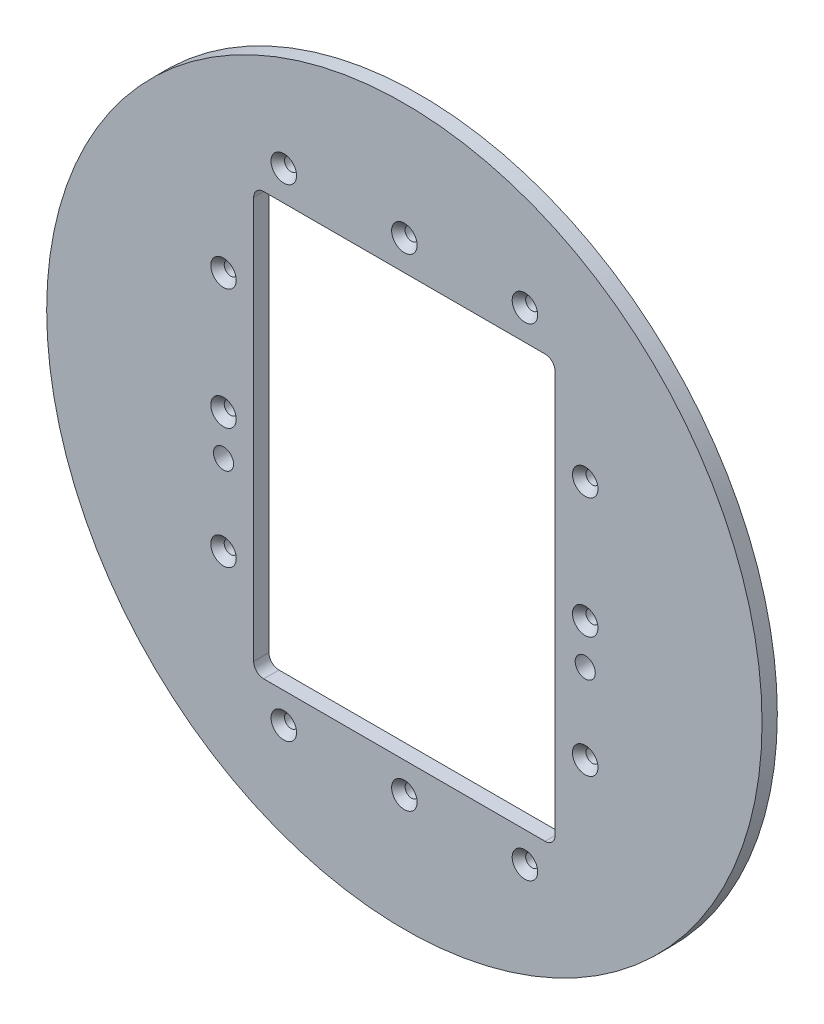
from build123d import *

# Parameters (mm, degrees)
SKETCH1_R                                         = 226.06
SKETCH1_W                                         = 190.5
SKETCH1_H                                         = 266.7
BOSS_EXTRUDE1_DEPTH                               = 9.652
CSK_FOR_5_16_FLAT_HEAD_MACHINE_SCREW1_D           = 8.2042
CSK_FOR_5_16_FLAT_HEAD_MACHINE_SCREW1_CSINK_D     = 16.12899111
CSK_FOR_5_16_FLAT_HEAD_MACHINE_SCREW1_CSINK_ANGLE = 82
F_1_2_0_5_DIAMETER_HOLE1_D                        = 12.7
FILLET1_R                                         = 6.35


with BuildPart() as part:
    # Sketch1 → Boss-Extrude1 (new body)
    with BuildSketch(Plane.XY):
        Circle(SKETCH1_R)
        Rectangle(SKETCH1_W, SKETCH1_H, mode=Mode.SUBTRACT)
    extrude(amount=-BOSS_EXTRUDE1_DEPTH)

    # CSK for 5_16 Flat Head Machine Screw1 (through all)
    with Locations(Plane.XY):
        with Locations((0, 152.4), (0, -152.4), (114.3, 76.2), (114.3, -76.2), (114.3, 0), (-114.3, 76.2), (-114.3, 0), (-114.3, -76.2), (-76.2, 152.4), (76.2, 152.4), (-76.2, -152.4), (76.2, -152.4)):
            CounterSinkHole(CSK_FOR_5_16_FLAT_HEAD_MACHINE_SCREW1_D / 2, CSK_FOR_5_16_FLAT_HEAD_MACHINE_SCREW1_CSINK_D / 2, counter_sink_angle=CSK_FOR_5_16_FLAT_HEAD_MACHINE_SCREW1_CSINK_ANGLE)

    # 1_2 _0.5_ Diameter Hole1 (through all)
    with Locations(Plane.XY):
        with Locations((-114.3, -25.4), (114.3, -25.4)):
            Hole(F_1_2_0_5_DIAMETER_HOLE1_D / 2)

    # Fillet1
    fillet1_edges = [part.edges().sort_by_distance(p)[0] for p in [
        (95.25, 133.35, -4.826),
        (95.25, -133.35, -4.826),
        (-95.25, -133.35, -4.826),
        (-95.25, 133.35, -4.826),
    ]]
    fillet(fillet1_edges, radius=FILLET1_R)


solid = part.part
